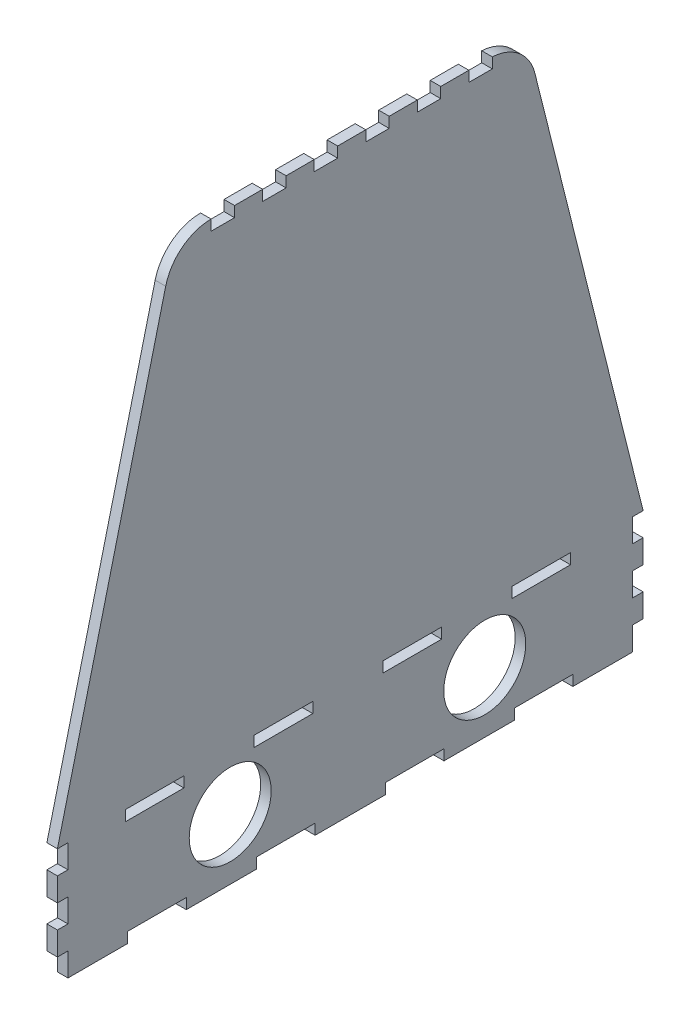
from build123d import *

# Parameters (mm, degrees)
BOSS_EXTRUDE1_DEPTH = 9
SKETCH5_R           = 35
SKETCH5_W           = 50
SKETCH5_H           = 9
SKETCH5_W_2         = 20
CUT_EXTRUDE2_DEPTH  = 436.463985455
SKETCH4_W           = 9
SKETCH4_H           = 20
CUT_EXTRUDE3_DEPTH  = 436.463985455


with BuildPart() as part:
    # Sketch2 → Boss-Extrude1 (new body)
    with BuildSketch(Plane(origin=(0, 0, 0), x_dir=(0, 0, -1), z_dir=(1, 0, 0))):
        with BuildLine():
            Line((250, -256.43776824), (157.57464375, 113.263656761))
            ThreePointArc((157.57464375, 113.263656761), (143.38543212, 135.09044928), (118.768943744, 143.56223176))
            Line((118.768943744, 143.56223176), (-118.768943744, 143.56223176))
            ThreePointArc((-118.768943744, 143.56223176), (-143.38543212, 135.09044928), (-157.57464375, 113.263656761))
            Line((-157.57464375, 113.263656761), (-250, -256.43776824))
            Line((-250, -256.43776824), (-250, -356.43776824))
            Line((-250, -356.43776824), (250, -356.43776824))
            Line((250, -356.43776824), (250, -256.43776824))
        make_face()
    extrude(amount=BOSS_EXTRUDE1_DEPTH)

    # Sketch5 → Cut-Extrude2 (cut, through all)
    with BuildSketch(Plane.ZY):
        with Locations((-114.807518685, -304.747962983)):
            Circle(SKETCH5_R)
        with Locations((102.483562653, -304.747962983)):
            Circle(SKETCH5_R)
        with Locations((-165, -351.93776824)):
            Rectangle(SKETCH5_W, SKETCH5_H)
        with Locations((-53, -260.93776824)):
            Rectangle(SKETCH5_W, SKETCH5_H)
        with Locations((-163, -260.93776824)):
            Rectangle(SKETCH5_W, SKETCH5_H)
        with Locations((-55, -351.93776824)):
            Rectangle(SKETCH5_W, SKETCH5_H)
        with Locations((57, -260.93776824)):
            Rectangle(SKETCH5_W, SKETCH5_H)
        with Locations((55, -351.93776824)):
            Rectangle(SKETCH5_W, SKETCH5_H)
        with Locations((167, -260.93776824)):
            Rectangle(SKETCH5_W, SKETCH5_H)
        with Locations((165, -351.93776824)):
            Rectangle(SKETCH5_W, SKETCH5_H)
        with Locations((64.768943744, 139.06223176)):
            Rectangle(SKETCH5_W_2, SKETCH5_H)
        with Locations((108.768943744, 139.06223176)):
            Rectangle(SKETCH5_W_2, SKETCH5_H)
        with Locations((20.768943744, 139.06223176)):
            Rectangle(SKETCH5_W_2, SKETCH5_H)
        with Locations((-23.231056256, 139.06223176)):
            Rectangle(SKETCH5_W_2, SKETCH5_H)
        with Locations((-67.231056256, 139.06223176)):
            Rectangle(SKETCH5_W_2, SKETCH5_H)
        with Locations((-111.231056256, 139.06223176)):
            Rectangle(SKETCH5_W_2, SKETCH5_H)
    extrude(amount=-CUT_EXTRUDE2_DEPTH, mode=Mode.SUBTRACT)

    # Sketch4 → Cut-Extrude3 (cut, through all)
    with BuildSketch(Plane(origin=(9, 0, 0), x_dir=(0, 0, -1), z_dir=(1, 0, 0))):
        with Locations((-245.5, -306.43776824)):
            Rectangle(SKETCH4_W, SKETCH4_H)
        with Locations((-245.5, -266.43776824)):
            Rectangle(SKETCH4_W, SKETCH4_H)
        with Locations((-245.5, -346.43776824)):
            Rectangle(SKETCH4_W, SKETCH4_H)
        with Locations((245.5, -266.43776824)):
            Rectangle(SKETCH4_W, SKETCH4_H)
        with Locations((245.5, -346.43776824)):
            Rectangle(SKETCH4_W, SKETCH4_H)
        with Locations((245.5, -306.43776824)):
            Rectangle(SKETCH4_W, SKETCH4_H)
    extrude(amount=-CUT_EXTRUDE3_DEPTH, mode=Mode.SUBTRACT)


solid = part.part
